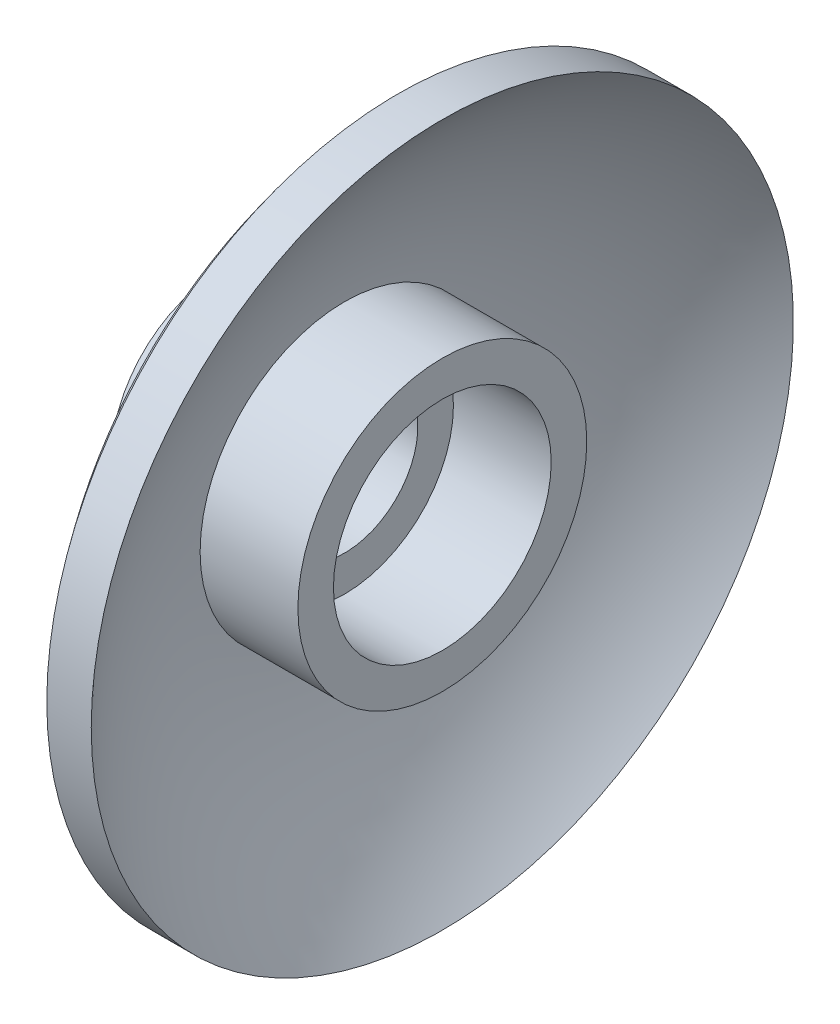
ISO-10303-21;
HEADER;
FILE_DESCRIPTION(('STEP AP214'),'2;1');
FILE_NAME('part.step','',(''),(''),'','','');
FILE_SCHEMA(('AUTOMOTIVE_DESIGN { 1 0 10303 214 1 1 1 1 }'));
ENDSEC;
DATA;
#1=APPLICATION_CONTEXT('core data for automotive mechanical design processes');
#2=APPLICATION_PROTOCOL_DEFINITION('international standard','automotive_design',2000,#1);
#3=PRODUCT_CONTEXT('',#1,'mechanical');
#4=PRODUCT('Part','Part','',(#3));
#5=PRODUCT_RELATED_PRODUCT_CATEGORY('part','',(#4));
#6=PRODUCT_DEFINITION_FORMATION('','',#4);
#7=PRODUCT_DEFINITION_CONTEXT('part definition',#1,'design');
#8=PRODUCT_DEFINITION('design','',#6,#7);
#9=PRODUCT_DEFINITION_SHAPE('','',#8);
#10=(LENGTH_UNIT() NAMED_UNIT(*) SI_UNIT(.MILLI.,.METRE.));
#11=(NAMED_UNIT(*) PLANE_ANGLE_UNIT() SI_UNIT($,.RADIAN.));
#12=(NAMED_UNIT(*) SI_UNIT($,.STERADIAN.) SOLID_ANGLE_UNIT());
#13=UNCERTAINTY_MEASURE_WITH_UNIT(LENGTH_MEASURE(1.E-05),#10,'distance_accuracy_value','');
#14=(GEOMETRIC_REPRESENTATION_CONTEXT(3) GLOBAL_UNCERTAINTY_ASSIGNED_CONTEXT((#13)) GLOBAL_UNIT_ASSIGNED_CONTEXT((#10,
#11,#12)) REPRESENTATION_CONTEXT('',''));
#15=CARTESIAN_POINT('',(0.,0.,0.));
#16=DIRECTION('',(0.,0.,1.));
#17=DIRECTION('',(1.,0.,0.));
#18=AXIS2_PLACEMENT_3D('',#15,#16,#17);
#19=CARTESIAN_POINT('',(22.7949274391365,0.,0.));
#20=DIRECTION('',(-1.,0.,0.));
#21=DIRECTION('',(0.,0.,1.));
#22=AXIS2_PLACEMENT_3D('',#19,#20,#21);
#23=DEGENERATE_TOROIDAL_SURFACE('',#22,2.33530539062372,8.,.T.);
#24=CARTESIAN_POINT('',(17.0473911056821,0.,0.));
#25=DIRECTION('',(-1.,0.,0.));
#26=DIRECTION('',(0.,0.,1.));
#27=AXIS2_PLACEMENT_3D('',#24,#25,#26);
#28=CIRCLE('',#27,7.9);
#29=CARTESIAN_POINT('',(17.0473911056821,0.,7.9));
#30=VERTEX_POINT('',#29);
#31=EDGE_CURVE('E58',#30,#30,#28,.T.);
#32=ORIENTED_EDGE('',*,*,#31,.F.);
#33=EDGE_LOOP('',(#32));
#34=FACE_BOUND('',#33,.T.);
#35=CARTESIAN_POINT('',(14.8473911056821,0.,0.));
#36=DIRECTION('',(-1.,0.,0.));
#37=DIRECTION('',(0.,0.,1.));
#38=AXIS2_PLACEMENT_3D('',#35,#36,#37);
#39=CIRCLE('',#38,3.25);
#40=CARTESIAN_POINT('',(14.8473911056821,0.,3.25));
#41=VERTEX_POINT('',#40);
#42=EDGE_CURVE('E10',#41,#41,#39,.T.);
#43=ORIENTED_EDGE('',*,*,#42,.T.);
#44=EDGE_LOOP('',(#43));
#45=FACE_BOUND('',#44,.T.);
#46=ADVANCED_FACE('F24',(#34,#45),#23,.F.);
#47=CARTESIAN_POINT('',(0.,0.,0.));
#48=DIRECTION('',(-1.,0.,0.));
#49=DIRECTION('',(0.,0.,1.));
#50=AXIS2_PLACEMENT_3D('',#47,#48,#49);
#51=CYLINDRICAL_SURFACE('',#50,3.25);
#52=ORIENTED_EDGE('',*,*,#42,.F.);
#53=EDGE_LOOP('',(#52));
#54=FACE_BOUND('',#53,.T.);
#55=CARTESIAN_POINT('',(17.0473911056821,0.,0.));
#56=DIRECTION('',(-1.,0.,0.));
#57=DIRECTION('',(0.,0.,1.));
#58=AXIS2_PLACEMENT_3D('',#55,#56,#57);
#59=CIRCLE('',#58,3.25);
#60=CARTESIAN_POINT('',(17.0473911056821,0.,3.25));
#61=VERTEX_POINT('',#60);
#62=EDGE_CURVE('E30',#61,#61,#59,.T.);
#63=ORIENTED_EDGE('',*,*,#62,.T.);
#64=EDGE_LOOP('',(#63));
#65=FACE_BOUND('',#64,.T.);
#66=ADVANCED_FACE('F65',(#54,#65),#51,.T.);
#67=CARTESIAN_POINT('',(17.0473911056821,3.25,0.));
#68=DIRECTION('',(-1.,0.,0.));
#69=DIRECTION('',(0.,0.,1.));
#70=AXIS2_PLACEMENT_3D('',#67,#68,#69);
#71=PLANE('',#70);
#72=ORIENTED_EDGE('',*,*,#62,.F.);
#73=EDGE_LOOP('',(#72));
#74=FACE_BOUND('',#73,.T.);
#75=CARTESIAN_POINT('',(17.0473911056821,0.,0.));
#76=DIRECTION('',(-1.,0.,0.));
#77=DIRECTION('',(0.,0.,1.));
#78=AXIS2_PLACEMENT_3D('',#75,#76,#77);
#79=CIRCLE('',#78,2.45);
#80=CARTESIAN_POINT('',(17.0473911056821,0.,2.45));
#81=VERTEX_POINT('',#80);
#82=EDGE_CURVE('E34',#81,#81,#79,.T.);
#83=ORIENTED_EDGE('',*,*,#82,.T.);
#84=EDGE_LOOP('',(#83));
#85=FACE_BOUND('',#84,.T.);
#86=ADVANCED_FACE('F69',(#74,#85),#71,.F.);
#87=CARTESIAN_POINT('',(0.,0.,0.));
#88=DIRECTION('',(-1.,0.,0.));
#89=DIRECTION('',(0.,0.,1.));
#90=AXIS2_PLACEMENT_3D('',#87,#88,#89);
#91=CYLINDRICAL_SURFACE('',#90,2.45);
#92=ORIENTED_EDGE('',*,*,#82,.F.);
#93=EDGE_LOOP('',(#92));
#94=FACE_BOUND('',#93,.T.);
#95=CARTESIAN_POINT('',(14.8473911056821,0.,0.));
#96=DIRECTION('',(-1.,0.,0.));
#97=DIRECTION('',(0.,0.,1.));
#98=AXIS2_PLACEMENT_3D('',#95,#96,#97);
#99=CIRCLE('',#98,2.45);
#100=CARTESIAN_POINT('',(14.8473911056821,0.,2.45));
#101=VERTEX_POINT('',#100);
#102=EDGE_CURVE('E38',#101,#101,#99,.T.);
#103=ORIENTED_EDGE('',*,*,#102,.T.);
#104=EDGE_LOOP('',(#103));
#105=FACE_BOUND('',#104,.T.);
#106=ADVANCED_FACE('F74',(#94,#105),#91,.F.);
#107=CARTESIAN_POINT('',(14.8473911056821,2.45,0.));
#108=DIRECTION('',(-1.,0.,0.));
#109=DIRECTION('',(0.,0.,1.));
#110=AXIS2_PLACEMENT_3D('',#107,#108,#109);
#111=PLANE('',#110);
#112=ORIENTED_EDGE('',*,*,#102,.F.);
#113=EDGE_LOOP('',(#112));
#114=FACE_BOUND('',#113,.T.);
#115=CARTESIAN_POINT('',(14.8473911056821,0.,0.));
#116=DIRECTION('',(-1.,0.,0.));
#117=DIRECTION('',(0.,0.,1.));
#118=AXIS2_PLACEMENT_3D('',#115,#116,#117);
#119=CIRCLE('',#118,1.65);
#120=CARTESIAN_POINT('',(14.8473911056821,0.,1.65));
#121=VERTEX_POINT('',#120);
#122=EDGE_CURVE('E43',#121,#121,#119,.T.);
#123=ORIENTED_EDGE('',*,*,#122,.T.);
#124=EDGE_LOOP('',(#123));
#125=FACE_BOUND('',#124,.T.);
#126=ADVANCED_FACE('F80',(#114,#125),#111,.F.);
#127=CARTESIAN_POINT('',(0.,0.,0.));
#128=DIRECTION('',(-1.,0.,0.));
#129=DIRECTION('',(0.,0.,1.));
#130=AXIS2_PLACEMENT_3D('',#127,#128,#129);
#131=CYLINDRICAL_SURFACE('',#130,1.65);
#132=ORIENTED_EDGE('',*,*,#122,.F.);
#133=EDGE_LOOP('',(#132));
#134=FACE_BOUND('',#133,.T.);
#135=CARTESIAN_POINT('',(12.0473911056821,0.,0.));
#136=DIRECTION('',(-1.,0.,0.));
#137=DIRECTION('',(0.,0.,1.));
#138=AXIS2_PLACEMENT_3D('',#135,#136,#137);
#139=CIRCLE('',#138,1.65);
#140=CARTESIAN_POINT('',(12.0473911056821,0.,1.65));
#141=VERTEX_POINT('',#140);
#142=EDGE_CURVE('E46',#141,#141,#139,.T.);
#143=ORIENTED_EDGE('',*,*,#142,.T.);
#144=EDGE_LOOP('',(#143));
#145=FACE_BOUND('',#144,.T.);
#146=ADVANCED_FACE('F84',(#134,#145),#131,.F.);
#147=CARTESIAN_POINT('',(12.0473911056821,2.45,0.));
#148=DIRECTION('',(1.,0.,0.));
#149=DIRECTION('',(0.,0.,-1.));
#150=AXIS2_PLACEMENT_3D('',#147,#148,#149);
#151=PLANE('',#150);
#152=ORIENTED_EDGE('',*,*,#142,.F.);
#153=EDGE_LOOP('',(#152));
#154=FACE_BOUND('',#153,.T.);
#155=CARTESIAN_POINT('',(12.0473911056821,0.,0.));
#156=DIRECTION('',(-1.,0.,0.));
#157=DIRECTION('',(0.,0.,1.));
#158=AXIS2_PLACEMENT_3D('',#155,#156,#157);
#159=CIRCLE('',#158,2.45);
#160=CARTESIAN_POINT('',(12.0473911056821,0.,2.45));
#161=VERTEX_POINT('',#160);
#162=EDGE_CURVE('E49',#161,#161,#159,.T.);
#163=ORIENTED_EDGE('',*,*,#162,.T.);
#164=EDGE_LOOP('',(#163));
#165=FACE_BOUND('',#164,.T.);
#166=ADVANCED_FACE('F88',(#154,#165),#151,.F.);
#167=CARTESIAN_POINT('',(0.,0.,0.));
#168=DIRECTION('',(-1.,0.,0.));
#169=DIRECTION('',(0.,0.,1.));
#170=AXIS2_PLACEMENT_3D('',#167,#168,#169);
#171=CYLINDRICAL_SURFACE('',#170,2.45);
#172=ORIENTED_EDGE('',*,*,#162,.F.);
#173=EDGE_LOOP('',(#172));
#174=FACE_BOUND('',#173,.T.);
#175=CARTESIAN_POINT('',(13.9035486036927,0.,0.));
#176=DIRECTION('',(-1.,0.,0.));
#177=DIRECTION('',(0.,0.,1.));
#178=AXIS2_PLACEMENT_3D('',#175,#176,#177);
#179=CIRCLE('',#178,2.45);
#180=CARTESIAN_POINT('',(13.9035486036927,0.,2.45));
#181=VERTEX_POINT('',#180);
#182=EDGE_CURVE('E52',#181,#181,#179,.T.);
#183=ORIENTED_EDGE('',*,*,#182,.T.);
#184=EDGE_LOOP('',(#183));
#185=FACE_BOUND('',#184,.T.);
#186=ADVANCED_FACE('F92',(#174,#185),#171,.T.);
#187=CARTESIAN_POINT('',(23.3856264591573,0.,0.));
#188=DIRECTION('',(-1.,0.,0.));
#189=DIRECTION('',(0.,0.,1.));
#190=AXIS2_PLACEMENT_3D('',#187,#188,#189);
#191=DEGENERATE_TOROIDAL_SURFACE('',#190,1.86673372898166,9.5,.T.);
#192=ORIENTED_EDGE('',*,*,#182,.F.);
#193=EDGE_LOOP('',(#192));
#194=FACE_BOUND('',#193,.T.);
#195=CARTESIAN_POINT('',(16.0473911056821,0.,0.));
#196=DIRECTION('',(-1.,0.,0.));
#197=DIRECTION('',(0.,0.,1.));
#198=AXIS2_PLACEMENT_3D('',#195,#196,#197);
#199=CIRCLE('',#198,7.9);
#200=CARTESIAN_POINT('',(16.0473911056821,0.,7.9));
#201=VERTEX_POINT('',#200);
#202=EDGE_CURVE('E55',#201,#201,#199,.T.);
#203=ORIENTED_EDGE('',*,*,#202,.T.);
#204=EDGE_LOOP('',(#203));
#205=FACE_BOUND('',#204,.T.);
#206=ADVANCED_FACE('F96',(#194,#205),#191,.T.);
#207=CARTESIAN_POINT('',(0.,0.,0.));
#208=DIRECTION('',(-1.,0.,0.));
#209=DIRECTION('',(0.,0.,1.));
#210=AXIS2_PLACEMENT_3D('',#207,#208,#209);
#211=CYLINDRICAL_SURFACE('',#210,7.9);
#212=ORIENTED_EDGE('',*,*,#202,.F.);
#213=EDGE_LOOP('',(#212));
#214=FACE_BOUND('',#213,.T.);
#215=ORIENTED_EDGE('',*,*,#31,.T.);
#216=EDGE_LOOP('',(#215));
#217=FACE_BOUND('',#216,.T.);
#218=ADVANCED_FACE('F62',(#214,#217),#211,.T.);
#219=CLOSED_SHELL('',(#46,#66,#86,#106,#126,#146,#166,#186,#206,#218));
#220=MANIFOLD_SOLID_BREP('B2',#219);
#221=ADVANCED_BREP_SHAPE_REPRESENTATION('',(#18,#220),#14);
#222=SHAPE_DEFINITION_REPRESENTATION(#9,#221);
ENDSEC;
END-ISO-10303-21;
